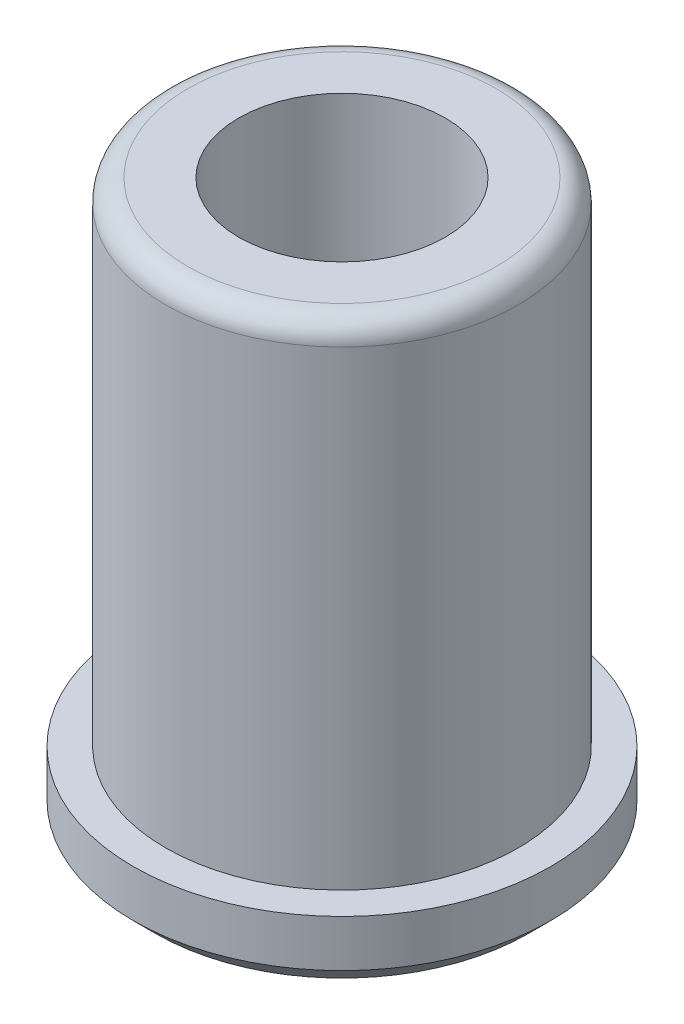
from build123d import *

# Parameters (mm, degrees)
SKETCH1_R           = 3.985
SKETCH1_R_2         = 2.335
BOSS_EXTRUDE1_DEPTH = 6.345
FILLET1_R           = 0.5
BOSS_EXTRUDE2_START = -1.56
SKETCH2_R           = 4.715
SKETCH2_R_2         = 3.985
BOSS_EXTRUDE2_DEPTH = 1.56
CHAMFER1_SIZE       = 0.5
CHAMFER2_SIZE       = 0.5


with BuildPart() as part:
    # Sketch1 → Boss-Extrude1 (new, symmetric)
    with BuildSketch(Plane(origin=(0, 0, 0), x_dir=(1, 0, 0), z_dir=(0, 1, 0))):
        with Locations(Location((0, 0, 0), (0, 0, 270))):
            Circle(SKETCH1_R)
        with Locations(Location((0, 0, 0), (0, 0, 270))):
            Circle(SKETCH1_R_2, mode=Mode.SUBTRACT)
    extrude(amount=BOSS_EXTRUDE1_DEPTH, both=True)

    # Fillet1
    fillet1_edges = [part.edges().sort_by_distance(p)[0] for p in [
        (0, 6.345, -3.985),
    ]]
    fillet(fillet1_edges, radius=FILLET1_R)

    # Sketch2 → Boss-Extrude2 (add)
    with BuildSketch(Plane.XZ.offset(6.345).offset(BOSS_EXTRUDE2_START)):
        with Locations(Location((0, 0, 0), (0, 0, 270))):
            Circle(SKETCH2_R)
        with Locations(Location((0, 0, 0), (0, 0, 270))):
            Circle(SKETCH2_R_2, mode=Mode.SUBTRACT)
    extrude(amount=BOSS_EXTRUDE2_DEPTH)

    # Chamfer1
    chamfer1_edges = [part.edges().sort_by_distance(p)[0] for p in [
        (0, -6.345, 4.715),
    ]]
    chamfer(chamfer1_edges, length=CHAMFER1_SIZE)

    # Chamfer2
    chamfer2_edges = [part.edges().sort_by_distance(p)[0] for p in [
        (0, -6.345, -2.335),
    ]]
    chamfer(chamfer2_edges, length=CHAMFER2_SIZE)


solid = part.part
